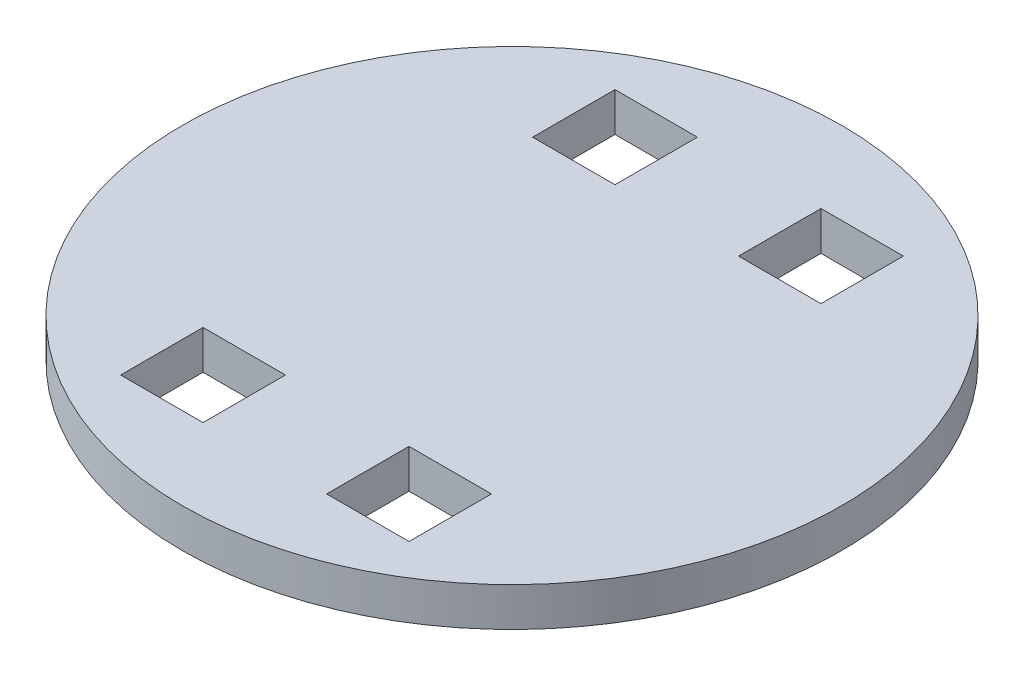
from build123d import *

# Parameters (mm, degrees)
SKETCH1_R           = 25.4
SKETCH1_W           = 6.35
SKETCH1_H           = 6.35
BOSS_EXTRUDE1_DEPTH = 2.9972


with BuildPart() as part:
    # Sketch1 → Boss-Extrude1 (new body)
    with BuildSketch(Plane(origin=(0, 0, 0), x_dir=(1, 0, 0), z_dir=(0, 1, 0))):
        with Locations(Location((0, 0, 0), (0, 0, 90))):
            Circle(SKETCH1_R)
        with Locations((-7.9375, 15.875)):
            Rectangle(SKETCH1_W, SKETCH1_H, mode=Mode.SUBTRACT)
        with Locations((7.9375, 15.875)):
            Rectangle(SKETCH1_W, SKETCH1_H, mode=Mode.SUBTRACT)
        with Locations((-7.9375, -15.875)):
            Rectangle(SKETCH1_W, SKETCH1_H, mode=Mode.SUBTRACT)
        with Locations((7.9375, -15.875)):
            Rectangle(SKETCH1_W, SKETCH1_H, mode=Mode.SUBTRACT)
    extrude(amount=BOSS_EXTRUDE1_DEPTH)


solid = part.part
